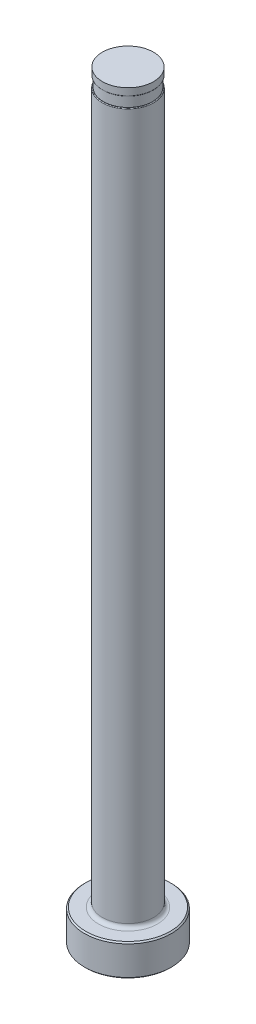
from build123d import *

# Parameters (mm, degrees)
CHAMFER1_SIZE     = 0.254
FILLET1_R         = 0.762
SKETCH2_W         = 0.2032
SKETCH2_H         = 2.032
D_SLOT_DEPTH      = 153.898684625
D_SLOT_DEPTH_BACK = 153.898684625
SKETCH5_W         = 0.0254
SKETCH5_H         = 1.524
FILLET2_R         = 0.127


with BuildPart() as part:
    # Sketch1 → Revolve1 (revolve)
    with BuildSketch(Plane.XY, mode=Mode.PRIVATE) as revolve1_sk:
        Polygon((0, 0), (-8.7249, 0), (-8.7249, 6.35), (-5.15874, 6.35), (-5.15874, 152.4), (0, 152.4), align=None)
    revolve(revolve1_sk.sketch.rotate(Axis((0, 259.958771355, 0), (0, -1, 0)), 270), axis=Axis((0, 259.958771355, 0), (0, -1, 0)))

    # Chamfer1
    chamfer1_edges = [part.edges().sort_by_distance(p)[0] for p in [
        (0, 6.35, -8.7249),
        (0, 0, -8.7249),
    ]]
    chamfer(chamfer1_edges, length=CHAMFER1_SIZE)

    # Fillet1
    fillet1_edges = [part.edges().sort_by_distance(p)[0] for p in [
        (0, 6.35, -5.15874),
    ]]
    fillet(fillet1_edges, radius=FILLET1_R)

    # Sketch2 → Vent Relief (revolve, cut)
    with BuildSketch(Plane.XY, mode=Mode.PRIVATE) as vent_relief_sk:
        with Locations((-5.05714, 149.86)):
            Rectangle(SKETCH2_W, SKETCH2_H)
    revolve(vent_relief_sk.sketch.rotate(Axis((0, 153.448281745, 0), (0, -1, 0)), 270), axis=Axis((0, 153.448281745, 0), (0, -1, 0)), mode=Mode.SUBTRACT)

    # Sketch3 → D-Slot (cut, two sides: drawn at the far end of the back side and taken through both)
    with BuildSketch(Plane.XY.offset(-D_SLOT_DEPTH_BACK)):
        with BuildLine():
            Line((-4.95554, 149.86), (-4.95554, 86.36))
            ThreePointArc((-4.95554, 86.36), (-5.006753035, 85.792038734), (-5.15874, 85.2424))
            Line((-5.15874, 85.2424), (-5.15874, 149.86))
            Line((-5.15874, 149.86), (-4.95554, 149.86))
        make_face()
    extrude(amount=D_SLOT_DEPTH + D_SLOT_DEPTH_BACK, mode=Mode.SUBTRACT)

    # Sketch5 → Vent Diameter (revolve, cut)
    with BuildSketch(Plane.XY, mode=Mode.PRIVATE) as vent_diameter_sk:
        with Locations((-5.14604, 151.638)):
            Rectangle(SKETCH5_W, SKETCH5_H)
    revolve(vent_diameter_sk.sketch.rotate(Axis((0, 152.687735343, 0), (0, -1, 0)), 90), axis=Axis((0, 152.687735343, 0), (0, -1, 0)), mode=Mode.SUBTRACT)

    # Fillet2
    fillet2_edges = [part.edges().sort_by_distance(p)[0] for p in [
        (4.123602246, 148.844, -3.099758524),
        (0, 150.876, 5.13334),
    ]]
    fillet(fillet2_edges, radius=FILLET2_R)


solid = part.part
